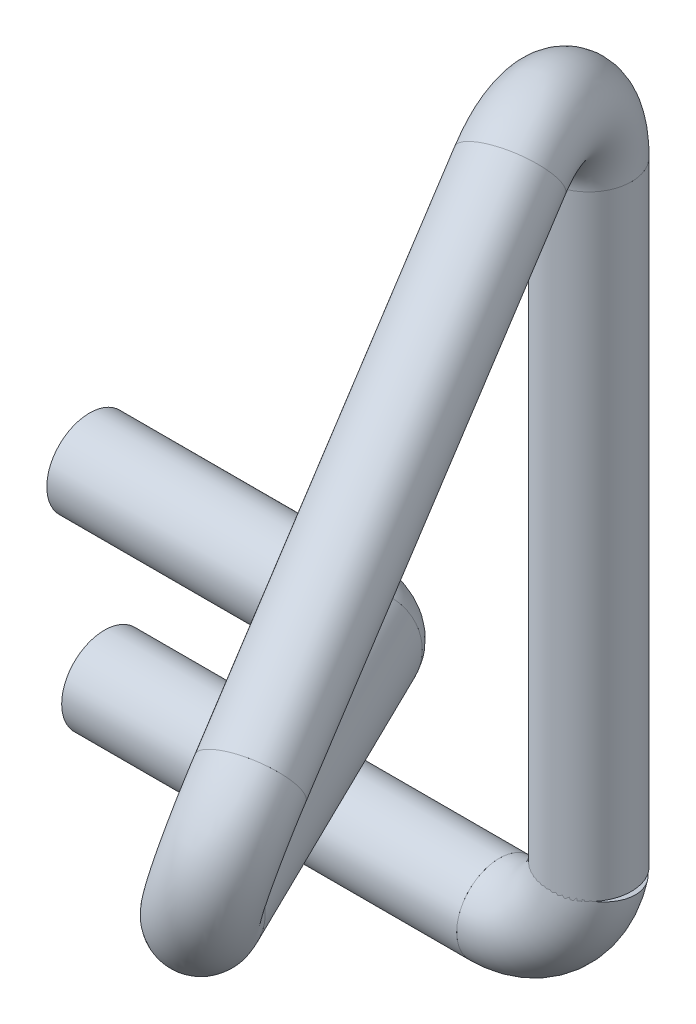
ISO-10303-21;
HEADER;
FILE_DESCRIPTION(('STEP AP214'),'2;1');
FILE_NAME('part.step','',(''),(''),'','','');
FILE_SCHEMA(('AUTOMOTIVE_DESIGN { 1 0 10303 214 1 1 1 1 }'));
ENDSEC;
DATA;
#1=APPLICATION_CONTEXT('core data for automotive mechanical design processes');
#2=APPLICATION_PROTOCOL_DEFINITION('international standard','automotive_design',2000,#1);
#3=PRODUCT_CONTEXT('',#1,'mechanical');
#4=PRODUCT('Part','Part','',(#3));
#5=PRODUCT_RELATED_PRODUCT_CATEGORY('part','',(#4));
#6=PRODUCT_DEFINITION_FORMATION('','',#4);
#7=PRODUCT_DEFINITION_CONTEXT('part definition',#1,'design');
#8=PRODUCT_DEFINITION('design','',#6,#7);
#9=PRODUCT_DEFINITION_SHAPE('','',#8);
#10=(LENGTH_UNIT() NAMED_UNIT(*) SI_UNIT(.MILLI.,.METRE.));
#11=(NAMED_UNIT(*) PLANE_ANGLE_UNIT() SI_UNIT($,.RADIAN.));
#12=(NAMED_UNIT(*) SI_UNIT($,.STERADIAN.) SOLID_ANGLE_UNIT());
#13=UNCERTAINTY_MEASURE_WITH_UNIT(LENGTH_MEASURE(1.E-05),#10,'distance_accuracy_value','');
#14=(GEOMETRIC_REPRESENTATION_CONTEXT(3) GLOBAL_UNCERTAINTY_ASSIGNED_CONTEXT((#13)) GLOBAL_UNIT_ASSIGNED_CONTEXT((#10,
#11,#12)) REPRESENTATION_CONTEXT('',''));
#15=CARTESIAN_POINT('',(0.,0.,0.));
#16=DIRECTION('',(0.,0.,1.));
#17=DIRECTION('',(1.,0.,0.));
#18=AXIS2_PLACEMENT_3D('',#15,#16,#17);
#19=CARTESIAN_POINT('',(0.,0.,0.));
#20=DIRECTION('',(1.,0.,0.));
#21=DIRECTION('',(0.,0.,-1.));
#22=AXIS2_PLACEMENT_3D('',#19,#20,#21);
#23=CYLINDRICAL_SURFACE('',#22,8.35);
#24=CARTESIAN_POINT('',(0.,0.,0.));
#25=DIRECTION('',(1.,0.,0.));
#26=DIRECTION('',(0.,-0.475574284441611,0.87967556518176));
#27=AXIS2_PLACEMENT_3D('',#24,#25,#26);
#28=CIRCLE('',#27,8.35);
#29=CARTESIAN_POINT('',(0.,-3.97104527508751,7.34529096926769));
#30=VERTEX_POINT('',#29);
#31=EDGE_CURVE('E51',#30,#30,#28,.T.);
#32=ORIENTED_EDGE('',*,*,#31,.F.);
#33=EDGE_LOOP('',(#32));
#34=FACE_BOUND('',#33,.T.);
#35=CARTESIAN_POINT('',(98.5727926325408,0.,0.));
#36=DIRECTION('',(1.,0.,0.));
#37=DIRECTION('',(0.,-0.475574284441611,0.87967556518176));
#38=AXIS2_PLACEMENT_3D('',#35,#36,#37);
#39=CIRCLE('',#38,8.35);
#40=CARTESIAN_POINT('',(98.5727926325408,-3.97104527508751,7.34529096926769));
#41=VERTEX_POINT('',#40);
#42=EDGE_CURVE('E57',#41,#41,#39,.T.);
#43=ORIENTED_EDGE('',*,*,#42,.T.);
#44=EDGE_LOOP('',(#43));
#45=FACE_BOUND('',#44,.T.);
#46=ADVANCED_FACE('F44',(#34,#45),#23,.F.);
#47=CARTESIAN_POINT('',(0.,0.,0.));
#48=DIRECTION('',(1.,0.,0.));
#49=DIRECTION('',(0.,0.,-1.));
#50=AXIS2_PLACEMENT_3D('',#47,#48,#49);
#51=CYLINDRICAL_SURFACE('',#50,10.65);
#52=CARTESIAN_POINT('',(0.,0.,0.));
#53=DIRECTION('',(1.,0.,0.));
#54=DIRECTION('',(0.,-0.475574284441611,0.87967556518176));
#55=AXIS2_PLACEMENT_3D('',#52,#53,#54);
#56=CIRCLE('',#55,10.65);
#57=CARTESIAN_POINT('',(0.,-5.06486612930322,9.36854476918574));
#58=VERTEX_POINT('',#57);
#59=EDGE_CURVE('E11',#58,#58,#56,.T.);
#60=ORIENTED_EDGE('',*,*,#59,.T.);
#61=EDGE_LOOP('',(#60));
#62=FACE_BOUND('',#61,.T.);
#63=CARTESIAN_POINT('',(98.5727926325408,0.,0.));
#64=DIRECTION('',(1.,0.,0.));
#65=DIRECTION('',(0.,-0.475574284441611,0.87967556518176));
#66=AXIS2_PLACEMENT_3D('',#63,#64,#65);
#67=CIRCLE('',#66,10.65);
#68=CARTESIAN_POINT('',(98.5727926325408,-5.06486612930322,9.36854476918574));
#69=VERTEX_POINT('',#68);
#70=EDGE_CURVE('E47',#69,#69,#67,.T.);
#71=ORIENTED_EDGE('',*,*,#70,.F.);
#72=EDGE_LOOP('',(#71));
#73=FACE_BOUND('',#72,.T.);
#74=ADVANCED_FACE('F66',(#62,#73),#51,.T.);
#75=CARTESIAN_POINT('',(0.,0.,0.));
#76=DIRECTION('',(1.,0.,0.));
#77=DIRECTION('',(0.,-0.475574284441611,0.87967556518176));
#78=AXIS2_PLACEMENT_3D('',#75,#76,#77);
#79=PLANE('',#78);
#80=ORIENTED_EDGE('',*,*,#31,.T.);
#81=EDGE_LOOP('',(#80));
#82=FACE_BOUND('',#81,.T.);
#83=ORIENTED_EDGE('',*,*,#59,.F.);
#84=EDGE_LOOP('',(#83));
#85=FACE_BOUND('',#84,.T.);
#86=ADVANCED_FACE('F68',(#82,#85),#79,.F.);
#87=CARTESIAN_POINT('',(98.5727926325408,0.,0.));
#88=DIRECTION('',(1.,0.,0.));
#89=DIRECTION('',(0.,-0.475574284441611,0.87967556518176));
#90=AXIS2_PLACEMENT_3D('',#87,#88,#89);
#91=PLANE('',#90);
#92=ORIENTED_EDGE('',*,*,#42,.F.);
#93=EDGE_LOOP('',(#92));
#94=FACE_BOUND('',#93,.T.);
#95=ORIENTED_EDGE('',*,*,#70,.T.);
#96=EDGE_LOOP('',(#95));
#97=FACE_BOUND('',#96,.T.);
#98=ADVANCED_FACE('F64',(#94,#97),#91,.T.);
#99=CLOSED_SHELL('',(#46,#74,#86,#98));
#100=MANIFOLD_SOLID_BREP('B2',#99);
#101=CARTESIAN_POINT('',(98.5727926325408,19.8088115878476,-2.75880109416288));
#102=DIRECTION('',(0.,0.137940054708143,0.990440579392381));
#103=DIRECTION('',(0.,-0.990440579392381,0.137940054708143));
#104=AXIS2_PLACEMENT_3D('',#101,#102,#103);
#105=TOROIDAL_SURFACE('',#104,20.0000000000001,8.35);
#106=CARTESIAN_POINT('',(98.5727926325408,0.,0.));
#107=DIRECTION('',(1.,0.,0.));
#108=DIRECTION('',(0.,-0.475574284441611,0.87967556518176));
#109=AXIS2_PLACEMENT_3D('',#106,#107,#108);
#110=CIRCLE('',#109,8.35);
#111=CARTESIAN_POINT('',(98.5727926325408,-8.27017883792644,1.15179945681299));
#112=VERTEX_POINT('',#111);
#113=EDGE_CURVE('E129',#112,#112,#110,.T.);
#114=CARTESIAN_POINT('',(118.438629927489,17.5182352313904,-2.43978929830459));
#115=DIRECTION('',(0.115634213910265,0.983796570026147,-0.137014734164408));
#116=DIRECTION('',(0.588396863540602,0.0432900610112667,0.80741259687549));
#117=AXIS2_PLACEMENT_3D('',#114,#115,#116);
#118=CIRCLE('',#117,8.35);
#119=CARTESIAN_POINT('',(126.732616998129,16.5619196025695,-2.30660187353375));
#120=VERTEX_POINT('',#119);
#121=EDGE_CURVE('E137',#120,#120,#118,.T.);
#122=CARTESIAN_POINT('',(98.5727926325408,19.8088115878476,-2.75880109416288));
#123=DIRECTION('',(0.,0.137940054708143,0.990440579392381));
#124=DIRECTION('',(0.,-0.990440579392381,0.137940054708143));
#125=AXIS2_PLACEMENT_3D('',#122,#123,#124);
#126=CIRCLE('',#125,28.3500000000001);
#127=EDGE_CURVE('',#112,#120,#126,.T.);
#128=ORIENTED_EDGE('',*,*,#113,.F.);
#129=ORIENTED_EDGE('',*,*,#121,.T.);
#130=ORIENTED_EDGE('',*,*,#127,.T.);
#131=ORIENTED_EDGE('',*,*,#127,.F.);
#132=EDGE_LOOP('',(#128,#130,#129,#131));
#133=FACE_BOUND('',#132,.T.);
#134=ADVANCED_FACE('F122',(#133),#105,.F.);
#135=CARTESIAN_POINT('',(98.5727926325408,19.8088115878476,-2.75880109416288));
#136=DIRECTION('',(0.,0.137940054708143,0.990440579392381));
#137=DIRECTION('',(0.,-0.990440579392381,0.137940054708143));
#138=AXIS2_PLACEMENT_3D('',#135,#136,#137);
#139=TOROIDAL_SURFACE('',#138,20.0000000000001,10.65);
#140=CARTESIAN_POINT('',(98.5727926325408,0.,0.));
#141=DIRECTION('',(1.,0.,0.));
#142=DIRECTION('',(0.,-0.475574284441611,0.87967556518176));
#143=AXIS2_PLACEMENT_3D('',#140,#141,#142);
#144=CIRCLE('',#143,10.65);
#145=CARTESIAN_POINT('',(98.5727926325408,-10.5481921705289,1.46906158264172));
#146=VERTEX_POINT('',#145);
#147=EDGE_CURVE('E43',#146,#146,#144,.T.);
#148=CARTESIAN_POINT('',(118.438629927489,17.5182352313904,-2.43978929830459));
#149=DIRECTION('',(0.115634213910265,0.983796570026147,-0.137014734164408));
#150=DIRECTION('',(0.588396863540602,0.0432900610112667,0.80741259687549));
#151=AXIS2_PLACEMENT_3D('',#148,#149,#150);
#152=CIRCLE('',#151,10.65);
#153=CARTESIAN_POINT('',(129.017188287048,16.2985033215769,-2.26991551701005));
#154=VERTEX_POINT('',#153);
#155=EDGE_CURVE('E133',#154,#154,#152,.T.);
#156=CARTESIAN_POINT('',(98.5727926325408,19.8088115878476,-2.75880109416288));
#157=DIRECTION('',(0.,0.137940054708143,0.990440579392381));
#158=DIRECTION('',(0.,-0.990440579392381,0.137940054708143));
#159=AXIS2_PLACEMENT_3D('',#156,#157,#158);
#160=CIRCLE('',#159,30.6500000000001);
#161=EDGE_CURVE('',#146,#154,#160,.T.);
#162=ORIENTED_EDGE('',*,*,#147,.T.);
#163=ORIENTED_EDGE('',*,*,#155,.F.);
#164=ORIENTED_EDGE('',*,*,#161,.T.);
#165=ORIENTED_EDGE('',*,*,#161,.F.);
#166=EDGE_LOOP('',(#162,#164,#163,#165));
#167=FACE_BOUND('',#166,.T.);
#168=ADVANCED_FACE('F124',(#167),#139,.T.);
#169=CARTESIAN_POINT('',(98.5727926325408,0.,0.));
#170=DIRECTION('',(1.,0.,0.));
#171=DIRECTION('',(0.,-0.475574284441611,0.87967556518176));
#172=AXIS2_PLACEMENT_3D('',#169,#170,#171);
#173=PLANE('',#172);
#174=ORIENTED_EDGE('',*,*,#113,.T.);
#175=EDGE_LOOP('',(#174));
#176=FACE_BOUND('',#175,.T.);
#177=ORIENTED_EDGE('',*,*,#147,.F.);
#178=EDGE_LOOP('',(#177));
#179=FACE_BOUND('',#178,.T.);
#180=ADVANCED_FACE('F147',(#176,#179),#173,.F.);
#181=CARTESIAN_POINT('',(118.438629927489,17.5182352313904,-2.43978929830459));
#182=DIRECTION('',(0.115634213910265,0.983796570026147,-0.137014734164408));
#183=DIRECTION('',(0.588396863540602,0.0432900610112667,0.80741259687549));
#184=AXIS2_PLACEMENT_3D('',#181,#182,#183);
#185=PLANE('',#184);
#186=ORIENTED_EDGE('',*,*,#121,.F.);
#187=EDGE_LOOP('',(#186));
#188=FACE_BOUND('',#187,.T.);
#189=ORIENTED_EDGE('',*,*,#155,.T.);
#190=EDGE_LOOP('',(#189));
#191=FACE_BOUND('',#190,.T.);
#192=ADVANCED_FACE('F144',(#188,#191),#185,.T.);
#193=CLOSED_SHELL('',(#134,#168,#180,#192));
#194=MANIFOLD_SOLID_BREP('B6',#193);
#195=CARTESIAN_POINT('',(118.438629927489,17.5182352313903,-2.43978929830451));
#196=DIRECTION('',(0.,1.,0.));
#197=DIRECTION('',(0.,0.,1.));
#198=AXIS2_PLACEMENT_3D('',#195,#196,#197);
#199=CYLINDRICAL_SURFACE('',#198,8.35);
#200=CARTESIAN_POINT('',(118.438629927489,17.5182352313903,-2.43978929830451));
#201=DIRECTION('',(0.,-1.,0.));
#202=DIRECTION('',(0.897332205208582,0.,0.441355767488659));
#203=AXIS2_PLACEMENT_3D('',#200,#201,#202);
#204=CIRCLE('',#203,8.35);
#205=CARTESIAN_POINT('',(125.93135384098,17.5182352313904,1.24553136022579));
#206=VERTEX_POINT('',#205);
#207=EDGE_CURVE('E207',#206,#206,#204,.T.);
#208=ORIENTED_EDGE('',*,*,#207,.T.);
#209=EDGE_LOOP('',(#208));
#210=FACE_BOUND('',#209,.T.);
#211=CARTESIAN_POINT('',(118.438629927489,170.871849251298,-2.43978929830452));
#212=DIRECTION('',(0.,-1.,0.));
#213=DIRECTION('',(0.897332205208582,0.,0.441355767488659));
#214=AXIS2_PLACEMENT_3D('',#211,#212,#213);
#215=CIRCLE('',#214,8.35);
#216=CARTESIAN_POINT('',(125.93135384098,170.871849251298,1.24553136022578));
#217=VERTEX_POINT('',#216);
#218=EDGE_CURVE('E213',#217,#217,#215,.T.);
#219=ORIENTED_EDGE('',*,*,#218,.F.);
#220=EDGE_LOOP('',(#219));
#221=FACE_BOUND('',#220,.T.);
#222=ADVANCED_FACE('F200',(#210,#221),#199,.F.);
#223=CARTESIAN_POINT('',(118.438629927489,17.5182352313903,-2.43978929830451));
#224=DIRECTION('',(0.,1.,0.));
#225=DIRECTION('',(0.,0.,1.));
#226=AXIS2_PLACEMENT_3D('',#223,#224,#225);
#227=CYLINDRICAL_SURFACE('',#226,10.65);
#228=CARTESIAN_POINT('',(118.438629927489,17.5182352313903,-2.43978929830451));
#229=DIRECTION('',(0.,-1.,0.));
#230=DIRECTION('',(0.897332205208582,0.,0.441355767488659));
#231=AXIS2_PLACEMENT_3D('',#228,#229,#230);
#232=CIRCLE('',#231,10.65);
#233=CARTESIAN_POINT('',(127.99521791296,17.5182352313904,2.2606496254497));
#234=VERTEX_POINT('',#233);
#235=EDGE_CURVE('E121',#234,#234,#232,.T.);
#236=ORIENTED_EDGE('',*,*,#235,.F.);
#237=EDGE_LOOP('',(#236));
#238=FACE_BOUND('',#237,.T.);
#239=CARTESIAN_POINT('',(118.438629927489,170.871849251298,-2.43978929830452));
#240=DIRECTION('',(0.,-1.,0.));
#241=DIRECTION('',(0.897332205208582,0.,0.441355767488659));
#242=AXIS2_PLACEMENT_3D('',#239,#240,#241);
#243=CIRCLE('',#242,10.65);
#244=CARTESIAN_POINT('',(127.99521791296,170.871849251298,2.26064962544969));
#245=VERTEX_POINT('',#244);
#246=EDGE_CURVE('E203',#245,#245,#243,.T.);
#247=ORIENTED_EDGE('',*,*,#246,.T.);
#248=EDGE_LOOP('',(#247));
#249=FACE_BOUND('',#248,.T.);
#250=ADVANCED_FACE('F220',(#238,#249),#227,.T.);
#251=CARTESIAN_POINT('',(118.438629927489,17.5182352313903,-2.43978929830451));
#252=DIRECTION('',(0.,-1.,0.));
#253=DIRECTION('',(0.897332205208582,0.,0.441355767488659));
#254=AXIS2_PLACEMENT_3D('',#251,#252,#253);
#255=PLANE('',#254);
#256=ORIENTED_EDGE('',*,*,#207,.F.);
#257=EDGE_LOOP('',(#256));
#258=FACE_BOUND('',#257,.T.);
#259=ORIENTED_EDGE('',*,*,#235,.T.);
#260=EDGE_LOOP('',(#259));
#261=FACE_BOUND('',#260,.T.);
#262=ADVANCED_FACE('F224',(#258,#261),#255,.T.);
#263=CARTESIAN_POINT('',(118.438629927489,170.871849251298,-2.43978929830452));
#264=DIRECTION('',(0.,-1.,0.));
#265=DIRECTION('',(0.897332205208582,0.,0.441355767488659));
#266=AXIS2_PLACEMENT_3D('',#263,#264,#265);
#267=PLANE('',#266);
#268=ORIENTED_EDGE('',*,*,#218,.T.);
#269=EDGE_LOOP('',(#268));
#270=FACE_BOUND('',#269,.T.);
#271=ORIENTED_EDGE('',*,*,#246,.F.);
#272=EDGE_LOOP('',(#271));
#273=FACE_BOUND('',#272,.T.);
#274=ADVANCED_FACE('F222',(#270,#273),#267,.F.);
#275=CLOSED_SHELL('',(#222,#250,#262,#274));
#276=MANIFOLD_SOLID_BREP('B38',#275);
#277=CARTESIAN_POINT('',(124.731940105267,170.871849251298,16.5442631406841));
#278=DIRECTION('',(0.949202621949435,0.,-0.314665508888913));
#279=DIRECTION('',(-0.314665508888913,0.,-0.949202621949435));
#280=AXIS2_PLACEMENT_3D('',#277,#278,#279);
#281=TOROIDAL_SURFACE('',#280,19.9999999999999,8.35);
#282=CARTESIAN_POINT('',(118.438629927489,170.871849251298,-2.43978929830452));
#283=DIRECTION('',(0.,-1.,0.));
#284=DIRECTION('',(0.897332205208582,0.,0.441355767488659));
#285=AXIS2_PLACEMENT_3D('',#282,#283,#284);
#286=CIRCLE('',#285,8.35);
#287=CARTESIAN_POINT('',(115.811172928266,170.871849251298,-10.3656311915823));
#288=VERTEX_POINT('',#287);
#289=EDGE_CURVE('E285',#288,#288,#286,.T.);
#290=CARTESIAN_POINT('',(128.178251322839,187.606457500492,26.9402155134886));
#291=DIRECTION('',(-0.263290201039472,0.547615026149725,-0.794226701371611));
#292=DIRECTION('',(0.555814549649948,-0.586795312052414,-0.588847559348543));
#293=AXIS2_PLACEMENT_3D('',#290,#291,#292);
#294=CIRCLE('',#293,8.35);
#295=CARTESIAN_POINT('',(129.617086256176,194.593156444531,31.2805256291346));
#296=VERTEX_POINT('',#295);
#297=EDGE_CURVE('E293',#296,#296,#294,.T.);
#298=CARTESIAN_POINT('',(124.731940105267,170.871849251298,16.5442631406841));
#299=DIRECTION('',(0.949202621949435,0.,-0.314665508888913));
#300=DIRECTION('',(-0.314665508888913,0.,-0.949202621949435));
#301=AXIS2_PLACEMENT_3D('',#298,#299,#300);
#302=CIRCLE('',#301,28.3499999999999);
#303=EDGE_CURVE('',#288,#296,#302,.T.);
#304=ORIENTED_EDGE('',*,*,#289,.T.);
#305=ORIENTED_EDGE('',*,*,#297,.F.);
#306=ORIENTED_EDGE('',*,*,#303,.T.);
#307=ORIENTED_EDGE('',*,*,#303,.F.);
#308=EDGE_LOOP('',(#304,#306,#305,#307));
#309=FACE_BOUND('',#308,.T.);
#310=ADVANCED_FACE('F278',(#309),#281,.F.);
#311=CARTESIAN_POINT('',(124.731940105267,170.871849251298,16.5442631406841));
#312=DIRECTION('',(0.949202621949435,0.,-0.314665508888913));
#313=DIRECTION('',(-0.314665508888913,0.,-0.949202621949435));
#314=AXIS2_PLACEMENT_3D('',#311,#312,#313);
#315=TOROIDAL_SURFACE('',#314,19.9999999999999,10.65);
#316=CARTESIAN_POINT('',(118.438629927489,170.871849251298,-2.43978929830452));
#317=DIRECTION('',(0.,-1.,0.));
#318=DIRECTION('',(0.897332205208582,0.,0.441355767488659));
#319=AXIS2_PLACEMENT_3D('',#316,#317,#318);
#320=CIRCLE('',#319,10.65);
#321=CARTESIAN_POINT('',(115.087442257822,170.871849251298,-12.548797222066));
#322=VERTEX_POINT('',#321);
#323=EDGE_CURVE('E199',#322,#322,#320,.T.);
#324=CARTESIAN_POINT('',(128.178251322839,187.606457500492,26.9402155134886));
#325=DIRECTION('',(-0.263290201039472,0.547615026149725,-0.794226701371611));
#326=DIRECTION('',(0.555814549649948,-0.586795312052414,-0.588847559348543));
#327=AXIS2_PLACEMENT_3D('',#324,#325,#326);
#328=CIRCLE('',#327,10.65);
#329=CARTESIAN_POINT('',(130.013412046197,196.517636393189,32.4760601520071));
#330=VERTEX_POINT('',#329);
#331=EDGE_CURVE('E289',#330,#330,#328,.T.);
#332=CARTESIAN_POINT('',(124.731940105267,170.871849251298,16.5442631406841));
#333=DIRECTION('',(0.949202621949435,0.,-0.314665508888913));
#334=DIRECTION('',(-0.314665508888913,0.,-0.949202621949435));
#335=AXIS2_PLACEMENT_3D('',#332,#333,#334);
#336=CIRCLE('',#335,30.6499999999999);
#337=EDGE_CURVE('',#322,#330,#336,.T.);
#338=ORIENTED_EDGE('',*,*,#323,.F.);
#339=ORIENTED_EDGE('',*,*,#331,.T.);
#340=ORIENTED_EDGE('',*,*,#337,.T.);
#341=ORIENTED_EDGE('',*,*,#337,.F.);
#342=EDGE_LOOP('',(#338,#340,#339,#341));
#343=FACE_BOUND('',#342,.T.);
#344=ADVANCED_FACE('F280',(#343),#315,.T.);
#345=CARTESIAN_POINT('',(118.438629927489,170.871849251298,-2.43978929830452));
#346=DIRECTION('',(0.,-1.,0.));
#347=DIRECTION('',(0.897332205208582,0.,0.441355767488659));
#348=AXIS2_PLACEMENT_3D('',#345,#346,#347);
#349=PLANE('',#348);
#350=ORIENTED_EDGE('',*,*,#289,.F.);
#351=EDGE_LOOP('',(#350));
#352=FACE_BOUND('',#351,.T.);
#353=ORIENTED_EDGE('',*,*,#323,.T.);
#354=EDGE_LOOP('',(#353));
#355=FACE_BOUND('',#354,.T.);
#356=ADVANCED_FACE('F303',(#352,#355),#349,.T.);
#357=CARTESIAN_POINT('',(128.178251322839,187.606457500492,26.9402155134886));
#358=DIRECTION('',(-0.263290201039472,0.547615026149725,-0.794226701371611));
#359=DIRECTION('',(0.555814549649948,-0.586795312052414,-0.588847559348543));
#360=AXIS2_PLACEMENT_3D('',#357,#358,#359);
#361=PLANE('',#360);
#362=ORIENTED_EDGE('',*,*,#297,.T.);
#363=EDGE_LOOP('',(#362));
#364=FACE_BOUND('',#363,.T.);
#365=ORIENTED_EDGE('',*,*,#331,.F.);
#366=EDGE_LOOP('',(#365));
#367=FACE_BOUND('',#366,.T.);
#368=ADVANCED_FACE('F299',(#364,#367),#361,.F.);
#369=CLOSED_SHELL('',(#310,#344,#356,#368));
#370=MANIFOLD_SOLID_BREP('B116',#369);
#371=CARTESIAN_POINT('',(128.178251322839,187.606457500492,26.9402155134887));
#372=DIRECTION('',(0.263290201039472,-0.547615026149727,0.79422670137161));
#373=DIRECTION('',(0.,-0.823274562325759,-0.56764336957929));
#374=AXIS2_PLACEMENT_3D('',#371,#372,#373);
#375=CYLINDRICAL_SURFACE('',#374,8.35);
#376=CARTESIAN_POINT('',(128.178251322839,187.606457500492,26.9402155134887));
#377=DIRECTION('',(-0.263290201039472,0.547615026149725,-0.794226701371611));
#378=DIRECTION('',(0.555814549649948,-0.586795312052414,-0.588847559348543));
#379=AXIS2_PLACEMENT_3D('',#376,#377,#378);
#380=CIRCLE('',#379,8.35);
#381=CARTESIAN_POINT('',(132.819302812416,182.706716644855,22.0233383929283));
#382=VERTEX_POINT('',#381);
#383=EDGE_CURVE('E363',#382,#382,#380,.T.);
#384=ORIENTED_EDGE('',*,*,#383,.T.);
#385=EDGE_LOOP('',(#384));
#386=FACE_BOUND('',#385,.T.);
#387=CARTESIAN_POINT('',(160.308627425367,120.778764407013,123.862936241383));
#388=DIRECTION('',(-0.263290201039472,0.547615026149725,-0.794226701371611));
#389=DIRECTION('',(0.555814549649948,-0.586795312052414,-0.588847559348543));
#390=AXIS2_PLACEMENT_3D('',#387,#388,#389);
#391=CIRCLE('',#390,8.35);
#392=CARTESIAN_POINT('',(164.949678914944,115.879023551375,118.946059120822));
#393=VERTEX_POINT('',#392);
#394=EDGE_CURVE('E369',#393,#393,#391,.T.);
#395=ORIENTED_EDGE('',*,*,#394,.F.);
#396=EDGE_LOOP('',(#395));
#397=FACE_BOUND('',#396,.T.);
#398=ADVANCED_FACE('F356',(#386,#397),#375,.F.);
#399=CARTESIAN_POINT('',(128.178251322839,187.606457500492,26.9402155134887));
#400=DIRECTION('',(0.263290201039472,-0.547615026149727,0.79422670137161));
#401=DIRECTION('',(0.,-0.823274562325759,-0.56764336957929));
#402=AXIS2_PLACEMENT_3D('',#399,#400,#401);
#403=CYLINDRICAL_SURFACE('',#402,10.65);
#404=CARTESIAN_POINT('',(128.178251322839,187.606457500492,26.9402155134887));
#405=DIRECTION('',(-0.263290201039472,0.547615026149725,-0.794226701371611));
#406=DIRECTION('',(0.555814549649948,-0.586795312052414,-0.588847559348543));
#407=AXIS2_PLACEMENT_3D('',#404,#405,#406);
#408=CIRCLE('',#407,10.65);
#409=CARTESIAN_POINT('',(134.097676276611,181.357087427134,20.6689890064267));
#410=VERTEX_POINT('',#409);
#411=EDGE_CURVE('E277',#410,#410,#408,.T.);
#412=ORIENTED_EDGE('',*,*,#411,.F.);
#413=EDGE_LOOP('',(#412));
#414=FACE_BOUND('',#413,.T.);
#415=CARTESIAN_POINT('',(160.308627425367,120.778764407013,123.862936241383));
#416=DIRECTION('',(-0.263290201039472,0.547615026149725,-0.794226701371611));
#417=DIRECTION('',(0.555814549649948,-0.586795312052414,-0.588847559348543));
#418=AXIS2_PLACEMENT_3D('',#415,#416,#417);
#419=CIRCLE('',#418,10.65);
#420=CARTESIAN_POINT('',(166.228052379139,114.529394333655,117.591709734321));
#421=VERTEX_POINT('',#420);
#422=EDGE_CURVE('E359',#421,#421,#419,.T.);
#423=ORIENTED_EDGE('',*,*,#422,.T.);
#424=EDGE_LOOP('',(#423));
#425=FACE_BOUND('',#424,.T.);
#426=ADVANCED_FACE('F376',(#414,#425),#403,.T.);
#427=CARTESIAN_POINT('',(128.178251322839,187.606457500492,26.9402155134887));
#428=DIRECTION('',(-0.263290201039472,0.547615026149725,-0.794226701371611));
#429=DIRECTION('',(0.555814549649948,-0.586795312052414,-0.588847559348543));
#430=AXIS2_PLACEMENT_3D('',#427,#428,#429);
#431=PLANE('',#430);
#432=ORIENTED_EDGE('',*,*,#383,.F.);
#433=EDGE_LOOP('',(#432));
#434=FACE_BOUND('',#433,.T.);
#435=ORIENTED_EDGE('',*,*,#411,.T.);
#436=EDGE_LOOP('',(#435));
#437=FACE_BOUND('',#436,.T.);
#438=ADVANCED_FACE('F380',(#434,#437),#431,.T.);
#439=CARTESIAN_POINT('',(160.308627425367,120.778764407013,123.862936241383));
#440=DIRECTION('',(-0.263290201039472,0.547615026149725,-0.794226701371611));
#441=DIRECTION('',(0.555814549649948,-0.586795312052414,-0.588847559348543));
#442=AXIS2_PLACEMENT_3D('',#439,#440,#441);
#443=PLANE('',#442);
#444=ORIENTED_EDGE('',*,*,#394,.T.);
#445=EDGE_LOOP('',(#444));
#446=FACE_BOUND('',#445,.T.);
#447=ORIENTED_EDGE('',*,*,#422,.F.);
#448=EDGE_LOOP('',(#447));
#449=FACE_BOUND('',#448,.T.);
#450=ADVANCED_FACE('F378',(#446,#449),#443,.F.);
#451=CLOSED_SHELL('',(#398,#426,#438,#450));
#452=MANIFOLD_SOLID_BREP('B194',#451);
#453=CARTESIAN_POINT('',(150.847667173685,104.962957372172,116.094379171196));
#454=DIRECTION('',(0.840775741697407,-0.273438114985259,-0.467255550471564));
#455=DIRECTION('',(-0.485768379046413,0.,-0.874087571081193));
#456=AXIS2_PLACEMENT_3D('',#453,#454,#455);
#457=TOROIDAL_SURFACE('',#456,19.9999999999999,8.35);
#458=CARTESIAN_POINT('',(160.308627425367,120.778764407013,123.862936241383));
#459=DIRECTION('',(-0.263290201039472,0.547615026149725,-0.794226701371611));
#460=DIRECTION('',(0.555814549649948,-0.586795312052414,-0.588847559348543));
#461=AXIS2_PLACEMENT_3D('',#458,#459,#460);
#462=CIRCLE('',#461,8.35);
#463=CARTESIAN_POINT('',(164.258578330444,127.381863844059,127.106308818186));
#464=VERTEX_POINT('',#463);
#465=EDGE_CURVE('E441',#464,#464,#462,.T.);
#466=CARTESIAN_POINT('',(149.166417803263,86.5920323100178,123.819824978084));
#467=DIRECTION('',(0.534817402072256,0.285489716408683,0.795277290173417));
#468=DIRECTION('',(0.795277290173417,0.147928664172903,-0.587921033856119));
#469=AXIS2_PLACEMENT_3D('',#466,#467,#468);
#470=CIRCLE('',#469,8.35);
#471=CARTESIAN_POINT('',(148.464496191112,78.9221710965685,127.045198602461));
#472=VERTEX_POINT('',#471);
#473=EDGE_CURVE('E449',#472,#472,#470,.T.);
#474=CARTESIAN_POINT('',(150.847667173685,104.962957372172,116.094379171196));
#475=DIRECTION('',(0.840775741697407,-0.273438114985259,-0.467255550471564));
#476=DIRECTION('',(-0.485768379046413,0.,-0.874087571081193));
#477=AXIS2_PLACEMENT_3D('',#474,#475,#476);
#478=CIRCLE('',#477,28.3499999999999);
#479=EDGE_CURVE('',#464,#472,#478,.T.);
#480=ORIENTED_EDGE('',*,*,#465,.T.);
#481=ORIENTED_EDGE('',*,*,#473,.F.);
#482=ORIENTED_EDGE('',*,*,#479,.T.);
#483=ORIENTED_EDGE('',*,*,#479,.F.);
#484=EDGE_LOOP('',(#480,#482,#481,#483));
#485=FACE_BOUND('',#484,.T.);
#486=ADVANCED_FACE('F434',(#485),#457,.F.);
#487=CARTESIAN_POINT('',(150.847667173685,104.962957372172,116.094379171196));
#488=DIRECTION('',(0.840775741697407,-0.273438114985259,-0.467255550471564));
#489=DIRECTION('',(-0.485768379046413,0.,-0.874087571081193));
#490=AXIS2_PLACEMENT_3D('',#487,#488,#489);
#491=TOROIDAL_SURFACE('',#490,19.9999999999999,10.65);
#492=CARTESIAN_POINT('',(160.308627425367,120.778764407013,123.862936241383));
#493=DIRECTION('',(-0.263290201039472,0.547615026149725,-0.794226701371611));
#494=DIRECTION('',(0.555814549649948,-0.586795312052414,-0.588847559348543));
#495=AXIS2_PLACEMENT_3D('',#492,#493,#494);
#496=CIRCLE('',#495,10.65);
#497=CARTESIAN_POINT('',(165.346588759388,129.200681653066,127.999692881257));
#498=VERTEX_POINT('',#497);
#499=EDGE_CURVE('E355',#498,#498,#496,.T.);
#500=CARTESIAN_POINT('',(149.166417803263,86.5920323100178,123.819824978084));
#501=DIRECTION('',(0.534817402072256,0.285489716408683,0.795277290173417));
#502=DIRECTION('',(0.795277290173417,0.147928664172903,-0.587921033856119));
#503=AXIS2_PLACEMENT_3D('',#500,#501,#502);
#504=CIRCLE('',#503,10.65);
#505=CARTESIAN_POINT('',(148.271152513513,76.8095147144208,127.933624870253));
#506=VERTEX_POINT('',#505);
#507=EDGE_CURVE('E445',#506,#506,#504,.T.);
#508=CARTESIAN_POINT('',(150.847667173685,104.962957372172,116.094379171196));
#509=DIRECTION('',(0.840775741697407,-0.273438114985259,-0.467255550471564));
#510=DIRECTION('',(-0.485768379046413,0.,-0.874087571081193));
#511=AXIS2_PLACEMENT_3D('',#508,#509,#510);
#512=CIRCLE('',#511,30.6499999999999);
#513=EDGE_CURVE('',#498,#506,#512,.T.);
#514=ORIENTED_EDGE('',*,*,#499,.F.);
#515=ORIENTED_EDGE('',*,*,#507,.T.);
#516=ORIENTED_EDGE('',*,*,#513,.T.);
#517=ORIENTED_EDGE('',*,*,#513,.F.);
#518=EDGE_LOOP('',(#514,#516,#515,#517));
#519=FACE_BOUND('',#518,.T.);
#520=ADVANCED_FACE('F436',(#519),#491,.T.);
#521=CARTESIAN_POINT('',(160.308627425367,120.778764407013,123.862936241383));
#522=DIRECTION('',(-0.263290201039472,0.547615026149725,-0.794226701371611));
#523=DIRECTION('',(0.555814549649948,-0.586795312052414,-0.588847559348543));
#524=AXIS2_PLACEMENT_3D('',#521,#522,#523);
#525=PLANE('',#524);
#526=ORIENTED_EDGE('',*,*,#465,.F.);
#527=EDGE_LOOP('',(#526));
#528=FACE_BOUND('',#527,.T.);
#529=ORIENTED_EDGE('',*,*,#499,.T.);
#530=EDGE_LOOP('',(#529));
#531=FACE_BOUND('',#530,.T.);
#532=ADVANCED_FACE('F459',(#528,#531),#525,.T.);
#533=CARTESIAN_POINT('',(149.166417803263,86.5920323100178,123.819824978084));
#534=DIRECTION('',(0.534817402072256,0.285489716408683,0.795277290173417));
#535=DIRECTION('',(0.795277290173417,0.147928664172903,-0.587921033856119));
#536=AXIS2_PLACEMENT_3D('',#533,#534,#535);
#537=PLANE('',#536);
#538=ORIENTED_EDGE('',*,*,#473,.T.);
#539=EDGE_LOOP('',(#538));
#540=FACE_BOUND('',#539,.T.);
#541=ORIENTED_EDGE('',*,*,#507,.F.);
#542=EDGE_LOOP('',(#541));
#543=FACE_BOUND('',#542,.T.);
#544=ADVANCED_FACE('F455',(#540,#543),#537,.F.);
#545=CLOSED_SHELL('',(#486,#520,#532,#544));
#546=MANIFOLD_SOLID_BREP('B272',#545);
#547=CARTESIAN_POINT('',(149.166417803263,86.5920323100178,123.819824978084));
#548=DIRECTION('',(-0.534817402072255,-0.285489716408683,-0.795277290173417));
#549=DIRECTION('',(-0.829812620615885,0.,0.558042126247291));
#550=AXIS2_PLACEMENT_3D('',#547,#548,#549);
#551=CYLINDRICAL_SURFACE('',#550,8.35);
#552=CARTESIAN_POINT('',(149.166417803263,86.5920323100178,123.819824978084));
#553=DIRECTION('',(0.534817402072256,0.285489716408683,0.795277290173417));
#554=DIRECTION('',(0.795277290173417,0.147928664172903,-0.587921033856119));
#555=AXIS2_PLACEMENT_3D('',#552,#553,#554);
#556=CIRCLE('',#555,8.35);
#557=CARTESIAN_POINT('',(155.806983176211,87.8272366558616,118.910684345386));
#558=VERTEX_POINT('',#557);
#559=EDGE_CURVE('E519',#558,#558,#556,.T.);
#560=ORIENTED_EDGE('',*,*,#559,.T.);
#561=EDGE_LOOP('',(#560));
#562=FACE_BOUND('',#561,.T.);
#563=CARTESIAN_POINT('',(68.7196604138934,43.6489233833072,4.19492314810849));
#564=DIRECTION('',(0.534817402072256,0.285489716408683,0.795277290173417));
#565=DIRECTION('',(0.795277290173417,0.147928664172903,-0.587921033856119));
#566=AXIS2_PLACEMENT_3D('',#563,#564,#565);
#567=CIRCLE('',#566,8.35);
#568=CARTESIAN_POINT('',(75.3602257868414,44.8841277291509,-0.714217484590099));
#569=VERTEX_POINT('',#568);
#570=EDGE_CURVE('E525',#569,#569,#567,.T.);
#571=ORIENTED_EDGE('',*,*,#570,.F.);
#572=EDGE_LOOP('',(#571));
#573=FACE_BOUND('',#572,.T.);
#574=ADVANCED_FACE('F512',(#562,#573),#551,.F.);
#575=CARTESIAN_POINT('',(149.166417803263,86.5920323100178,123.819824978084));
#576=DIRECTION('',(-0.534817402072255,-0.285489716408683,-0.795277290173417));
#577=DIRECTION('',(-0.829812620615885,0.,0.558042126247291));
#578=AXIS2_PLACEMENT_3D('',#575,#576,#577);
#579=CYLINDRICAL_SURFACE('',#578,10.65);
#580=CARTESIAN_POINT('',(149.166417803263,86.5920323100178,123.819824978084));
#581=DIRECTION('',(0.534817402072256,0.285489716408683,0.795277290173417));
#582=DIRECTION('',(0.795277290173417,0.147928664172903,-0.587921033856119));
#583=AXIS2_PLACEMENT_3D('',#580,#581,#582);
#584=CIRCLE('',#583,10.65);
#585=CARTESIAN_POINT('',(157.63612094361,88.1674725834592,117.558465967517));
#586=VERTEX_POINT('',#585);
#587=EDGE_CURVE('E433',#586,#586,#584,.T.);
#588=ORIENTED_EDGE('',*,*,#587,.F.);
#589=EDGE_LOOP('',(#588));
#590=FACE_BOUND('',#589,.T.);
#591=CARTESIAN_POINT('',(68.7196604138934,43.6489233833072,4.19492314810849));
#592=DIRECTION('',(0.534817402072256,0.285489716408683,0.795277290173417));
#593=DIRECTION('',(0.795277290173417,0.147928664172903,-0.587921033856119));
#594=AXIS2_PLACEMENT_3D('',#591,#592,#593);
#595=CIRCLE('',#594,10.65);
#596=CARTESIAN_POINT('',(77.1893635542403,45.2243636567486,-2.06643586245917));
#597=VERTEX_POINT('',#596);
#598=EDGE_CURVE('E515',#597,#597,#595,.T.);
#599=ORIENTED_EDGE('',*,*,#598,.T.);
#600=EDGE_LOOP('',(#599));
#601=FACE_BOUND('',#600,.T.);
#602=ADVANCED_FACE('F532',(#590,#601),#579,.T.);
#603=CARTESIAN_POINT('',(149.166417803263,86.5920323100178,123.819824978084));
#604=DIRECTION('',(0.534817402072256,0.285489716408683,0.795277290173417));
#605=DIRECTION('',(0.795277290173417,0.147928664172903,-0.587921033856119));
#606=AXIS2_PLACEMENT_3D('',#603,#604,#605);
#607=PLANE('',#606);
#608=ORIENTED_EDGE('',*,*,#559,.F.);
#609=EDGE_LOOP('',(#608));
#610=FACE_BOUND('',#609,.T.);
#611=ORIENTED_EDGE('',*,*,#587,.T.);
#612=EDGE_LOOP('',(#611));
#613=FACE_BOUND('',#612,.T.);
#614=ADVANCED_FACE('F536',(#610,#613),#607,.T.);
#615=CARTESIAN_POINT('',(68.7196604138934,43.6489233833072,4.19492314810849));
#616=DIRECTION('',(0.534817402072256,0.285489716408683,0.795277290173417));
#617=DIRECTION('',(0.795277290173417,0.147928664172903,-0.587921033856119));
#618=AXIS2_PLACEMENT_3D('',#615,#616,#617);
#619=PLANE('',#618);
#620=ORIENTED_EDGE('',*,*,#570,.T.);
#621=EDGE_LOOP('',(#620));
#622=FACE_BOUND('',#621,.T.);
#623=ORIENTED_EDGE('',*,*,#598,.F.);
#624=EDGE_LOOP('',(#623));
#625=FACE_BOUND('',#624,.T.);
#626=ADVANCED_FACE('F534',(#622,#625),#619,.F.);
#627=CLOSED_SHELL('',(#574,#602,#614,#626));
#628=MANIFOLD_SOLID_BREP('B350',#627);
#629=CARTESIAN_POINT('',(51.8203072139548,47.2629047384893,14.2622465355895));
#630=DIRECTION('',(0.,0.941192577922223,-0.337870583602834));
#631=DIRECTION('',(0.,0.337870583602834,0.941192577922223));
#632=AXIS2_PLACEMENT_3D('',#629,#630,#631);
#633=TOROIDAL_SURFACE('',#632,20.,8.35);
#634=CARTESIAN_POINT('',(68.7196604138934,43.6489233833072,4.19492314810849));
#635=DIRECTION('',(0.534817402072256,0.285489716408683,0.795277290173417));
#636=DIRECTION('',(0.795277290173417,0.147928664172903,-0.587921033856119));
#637=AXIS2_PLACEMENT_3D('',#634,#635,#636);
#638=CIRCLE('',#637,8.35);
#639=CARTESIAN_POINT('',(75.7751403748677,42.1400861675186,-0.00818436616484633));
#640=VERTEX_POINT('',#639);
#641=EDGE_CURVE('E596',#640,#640,#638,.T.);
#642=CARTESIAN_POINT('',(51.8203072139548,40.5054930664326,-4.56160502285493));
#643=DIRECTION('',(1.,0.,0.));
#644=DIRECTION('',(0.,0.,-1.));
#645=AXIS2_PLACEMENT_3D('',#642,#643,#644);
#646=CIRCLE('',#645,8.35);
#647=CARTESIAN_POINT('',(51.8203072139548,37.6842736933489,-12.4205630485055));
#648=VERTEX_POINT('',#647);
#649=EDGE_CURVE('E604',#648,#648,#646,.T.);
#650=CARTESIAN_POINT('',(51.8203072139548,47.2629047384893,14.2622465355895));
#651=DIRECTION('',(0.,0.941192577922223,-0.337870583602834));
#652=DIRECTION('',(0.,0.337870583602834,0.941192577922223));
#653=AXIS2_PLACEMENT_3D('',#650,#651,#652);
#654=CIRCLE('',#653,28.35);
#655=EDGE_CURVE('',#640,#648,#654,.T.);
#656=ORIENTED_EDGE('',*,*,#641,.T.);
#657=ORIENTED_EDGE('',*,*,#649,.F.);
#658=ORIENTED_EDGE('',*,*,#655,.T.);
#659=ORIENTED_EDGE('',*,*,#655,.F.);
#660=EDGE_LOOP('',(#656,#658,#657,#659));
#661=FACE_BOUND('',#660,.T.);
#662=ADVANCED_FACE('F589',(#661),#633,.F.);
#663=CARTESIAN_POINT('',(51.8203072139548,47.2629047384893,14.2622465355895));
#664=DIRECTION('',(0.,0.941192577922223,-0.337870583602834));
#665=DIRECTION('',(0.,0.337870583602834,0.941192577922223));
#666=AXIS2_PLACEMENT_3D('',#663,#664,#665);
#667=TOROIDAL_SURFACE('',#666,20.,10.65);
#668=CARTESIAN_POINT('',(68.7196604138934,43.6489233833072,4.19492314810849));
#669=DIRECTION('',(0.534817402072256,0.285489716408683,0.795277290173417));
#670=DIRECTION('',(0.795277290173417,0.147928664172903,-0.587921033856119));
#671=AXIS2_PLACEMENT_3D('',#668,#669,#670);
#672=CIRCLE('',#671,10.65);
#673=CARTESIAN_POINT('',(77.7185659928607,41.7244783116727,-1.16592655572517));
#674=VERTEX_POINT('',#673);
#675=EDGE_CURVE('E511',#674,#674,#672,.T.);
#676=CARTESIAN_POINT('',(51.8203072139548,40.5054930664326,-4.56160502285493));
#677=DIRECTION('',(1.,0.,0.));
#678=DIRECTION('',(0.,0.,-1.));
#679=AXIS2_PLACEMENT_3D('',#676,#677,#678);
#680=CIRCLE('',#679,10.65);
#681=CARTESIAN_POINT('',(51.8203072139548,36.9071713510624,-14.5853059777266));
#682=VERTEX_POINT('',#681);
#683=EDGE_CURVE('E600',#682,#682,#680,.T.);
#684=CARTESIAN_POINT('',(51.8203072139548,47.2629047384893,14.2622465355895));
#685=DIRECTION('',(0.,0.941192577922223,-0.337870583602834));
#686=DIRECTION('',(0.,0.337870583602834,0.941192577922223));
#687=AXIS2_PLACEMENT_3D('',#684,#685,#686);
#688=CIRCLE('',#687,30.65);
#689=EDGE_CURVE('',#674,#682,#688,.T.);
#690=ORIENTED_EDGE('',*,*,#675,.F.);
#691=ORIENTED_EDGE('',*,*,#683,.T.);
#692=ORIENTED_EDGE('',*,*,#689,.T.);
#693=ORIENTED_EDGE('',*,*,#689,.F.);
#694=EDGE_LOOP('',(#690,#692,#691,#693));
#695=FACE_BOUND('',#694,.T.);
#696=ADVANCED_FACE('F591',(#695),#667,.T.);
#697=CARTESIAN_POINT('',(68.7196604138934,43.6489233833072,4.19492314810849));
#698=DIRECTION('',(0.534817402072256,0.285489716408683,0.795277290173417));
#699=DIRECTION('',(0.795277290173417,0.147928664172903,-0.587921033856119));
#700=AXIS2_PLACEMENT_3D('',#697,#698,#699);
#701=PLANE('',#700);
#702=ORIENTED_EDGE('',*,*,#641,.F.);
#703=EDGE_LOOP('',(#702));
#704=FACE_BOUND('',#703,.T.);
#705=ORIENTED_EDGE('',*,*,#675,.T.);
#706=EDGE_LOOP('',(#705));
#707=FACE_BOUND('',#706,.T.);
#708=ADVANCED_FACE('F614',(#704,#707),#701,.T.);
#709=CARTESIAN_POINT('',(51.8203072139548,40.5054930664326,-4.56160502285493));
#710=DIRECTION('',(1.,0.,0.));
#711=DIRECTION('',(0.,0.,-1.));
#712=AXIS2_PLACEMENT_3D('',#709,#710,#711);
#713=PLANE('',#712);
#714=ORIENTED_EDGE('',*,*,#649,.T.);
#715=EDGE_LOOP('',(#714));
#716=FACE_BOUND('',#715,.T.);
#717=ORIENTED_EDGE('',*,*,#683,.F.);
#718=EDGE_LOOP('',(#717));
#719=FACE_BOUND('',#718,.T.);
#720=ADVANCED_FACE('F610',(#716,#719),#713,.F.);
#721=CLOSED_SHELL('',(#662,#696,#708,#720));
#722=MANIFOLD_SOLID_BREP('B428',#721);
#723=CARTESIAN_POINT('',(51.8203072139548,40.5054930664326,-4.56160502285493));
#724=DIRECTION('',(-1.,0.,0.));
#725=DIRECTION('',(0.,0.,1.));
#726=AXIS2_PLACEMENT_3D('',#723,#724,#725);
#727=CYLINDRICAL_SURFACE('',#726,8.35);
#728=CARTESIAN_POINT('',(51.8203072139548,40.5054930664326,-4.56160502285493));
#729=DIRECTION('',(1.,0.,0.));
#730=DIRECTION('',(0.,0.,-1.));
#731=AXIS2_PLACEMENT_3D('',#728,#729,#730);
#732=CIRCLE('',#731,8.35);
#733=CARTESIAN_POINT('',(51.8203072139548,40.5054930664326,-12.9116050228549));
#734=VERTEX_POINT('',#733);
#735=EDGE_CURVE('E666',#734,#734,#732,.T.);
#736=ORIENTED_EDGE('',*,*,#735,.T.);
#737=EDGE_LOOP('',(#736));
#738=FACE_BOUND('',#737,.T.);
#739=CARTESIAN_POINT('',(-8.27601781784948,40.5054930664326,-4.56160502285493));
#740=DIRECTION('',(1.,0.,0.));
#741=DIRECTION('',(0.,0.,-1.));
#742=AXIS2_PLACEMENT_3D('',#739,#740,#741);
#743=CIRCLE('',#742,8.35);
#744=CARTESIAN_POINT('',(-8.27601781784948,40.5054930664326,-12.9116050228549));
#745=VERTEX_POINT('',#744);
#746=EDGE_CURVE('E672',#745,#745,#743,.T.);
#747=ORIENTED_EDGE('',*,*,#746,.F.);
#748=EDGE_LOOP('',(#747));
#749=FACE_BOUND('',#748,.T.);
#750=ADVANCED_FACE('F659',(#738,#749),#727,.F.);
#751=CARTESIAN_POINT('',(51.8203072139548,40.5054930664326,-4.56160502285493));
#752=DIRECTION('',(-1.,0.,0.));
#753=DIRECTION('',(0.,0.,1.));
#754=AXIS2_PLACEMENT_3D('',#751,#752,#753);
#755=CYLINDRICAL_SURFACE('',#754,10.65);
#756=CARTESIAN_POINT('',(51.8203072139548,40.5054930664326,-4.56160502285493));
#757=DIRECTION('',(1.,0.,0.));
#758=DIRECTION('',(0.,0.,-1.));
#759=AXIS2_PLACEMENT_3D('',#756,#757,#758);
#760=CIRCLE('',#759,10.65);
#761=CARTESIAN_POINT('',(51.8203072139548,40.5054930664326,-15.2116050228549));
#762=VERTEX_POINT('',#761);
#763=EDGE_CURVE('E588',#762,#762,#760,.T.);
#764=ORIENTED_EDGE('',*,*,#763,.F.);
#765=EDGE_LOOP('',(#764));
#766=FACE_BOUND('',#765,.T.);
#767=CARTESIAN_POINT('',(-8.27601781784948,40.5054930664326,-4.56160502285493));
#768=DIRECTION('',(1.,0.,0.));
#769=DIRECTION('',(0.,0.,-1.));
#770=AXIS2_PLACEMENT_3D('',#767,#768,#769);
#771=CIRCLE('',#770,10.65);
#772=CARTESIAN_POINT('',(-8.27601781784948,40.5054930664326,-15.2116050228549));
#773=VERTEX_POINT('',#772);
#774=EDGE_CURVE('E662',#773,#773,#771,.T.);
#775=ORIENTED_EDGE('',*,*,#774,.T.);
#776=EDGE_LOOP('',(#775));
#777=FACE_BOUND('',#776,.T.);
#778=ADVANCED_FACE('F679',(#766,#777),#755,.T.);
#779=CARTESIAN_POINT('',(51.8203072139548,40.5054930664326,-4.56160502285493));
#780=DIRECTION('',(1.,0.,0.));
#781=DIRECTION('',(0.,0.,-1.));
#782=AXIS2_PLACEMENT_3D('',#779,#780,#781);
#783=PLANE('',#782);
#784=ORIENTED_EDGE('',*,*,#735,.F.);
#785=EDGE_LOOP('',(#784));
#786=FACE_BOUND('',#785,.T.);
#787=ORIENTED_EDGE('',*,*,#763,.T.);
#788=EDGE_LOOP('',(#787));
#789=FACE_BOUND('',#788,.T.);
#790=ADVANCED_FACE('F683',(#786,#789),#783,.T.);
#791=CARTESIAN_POINT('',(-8.27601781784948,40.5054930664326,-4.56160502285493));
#792=DIRECTION('',(1.,0.,0.));
#793=DIRECTION('',(0.,0.,-1.));
#794=AXIS2_PLACEMENT_3D('',#791,#792,#793);
#795=PLANE('',#794);
#796=ORIENTED_EDGE('',*,*,#746,.T.);
#797=EDGE_LOOP('',(#796));
#798=FACE_BOUND('',#797,.T.);
#799=ORIENTED_EDGE('',*,*,#774,.F.);
#800=EDGE_LOOP('',(#799));
#801=FACE_BOUND('',#800,.T.);
#802=ADVANCED_FACE('F681',(#798,#801),#795,.F.);
#803=CLOSED_SHELL('',(#750,#778,#790,#802));
#804=MANIFOLD_SOLID_BREP('B506',#803);
#805=ADVANCED_BREP_SHAPE_REPRESENTATION('',(#18,#100,#194,#276,#370,#452,#546,#628,#722,#804),#14);
#806=SHAPE_DEFINITION_REPRESENTATION(#9,#805);
ENDSEC;
END-ISO-10303-21;
